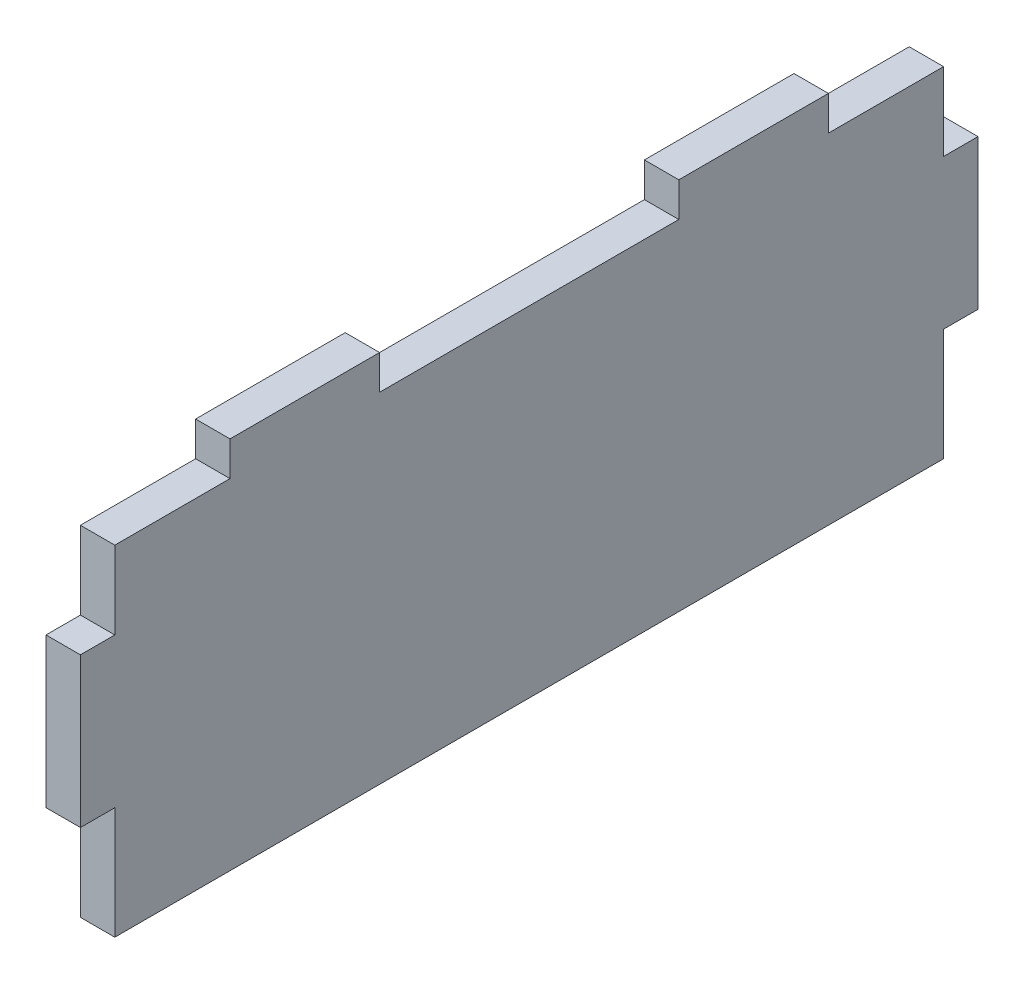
ISO-10303-21;
HEADER;
FILE_DESCRIPTION(('STEP AP214'),'2;1');
FILE_NAME('part.step','',(''),(''),'','','');
FILE_SCHEMA(('AUTOMOTIVE_DESIGN { 1 0 10303 214 1 1 1 1 }'));
ENDSEC;
DATA;
#1=APPLICATION_CONTEXT('core data for automotive mechanical design processes');
#2=APPLICATION_PROTOCOL_DEFINITION('international standard','automotive_design',2000,#1);
#3=PRODUCT_CONTEXT('',#1,'mechanical');
#4=PRODUCT('Part','Part','',(#3));
#5=PRODUCT_RELATED_PRODUCT_CATEGORY('part','',(#4));
#6=PRODUCT_DEFINITION_FORMATION('','',#4);
#7=PRODUCT_DEFINITION_CONTEXT('part definition',#1,'design');
#8=PRODUCT_DEFINITION('design','',#6,#7);
#9=PRODUCT_DEFINITION_SHAPE('','',#8);
#10=(LENGTH_UNIT() NAMED_UNIT(*) SI_UNIT(.MILLI.,.METRE.));
#11=(NAMED_UNIT(*) PLANE_ANGLE_UNIT() SI_UNIT($,.RADIAN.));
#12=(NAMED_UNIT(*) SI_UNIT($,.STERADIAN.) SOLID_ANGLE_UNIT());
#13=UNCERTAINTY_MEASURE_WITH_UNIT(LENGTH_MEASURE(1.E-05),#10,'distance_accuracy_value','');
#14=(GEOMETRIC_REPRESENTATION_CONTEXT(3) GLOBAL_UNCERTAINTY_ASSIGNED_CONTEXT((#13)) GLOBAL_UNIT_ASSIGNED_CONTEXT((#10,
#11,#12)) REPRESENTATION_CONTEXT('',''));
#15=CARTESIAN_POINT('',(0.,0.,0.));
#16=DIRECTION('',(0.,0.,1.));
#17=DIRECTION('',(1.,0.,0.));
#18=AXIS2_PLACEMENT_3D('',#15,#16,#17);
#19=CARTESIAN_POINT('',(5.842,59.2737638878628,-1.2954153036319E-13));
#20=DIRECTION('',(0.,1.,0.));
#21=DIRECTION('',(0.,0.,1.));
#22=AXIS2_PLACEMENT_3D('',#19,#20,#21);
#23=PLANE('',#22);
#24=DIRECTION('',(0.,0.,-1.));
#25=VECTOR('',#24,1.);
#26=CARTESIAN_POINT('',(0.,59.2737638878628,-1.2954153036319E-13));
#27=LINE('',#26,#25);
#28=CARTESIAN_POINT('',(0.,59.2737638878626,-101.6));
#29=VERTEX_POINT('',#28);
#30=CARTESIAN_POINT('',(0.,59.2737638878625,-127.));
#31=VERTEX_POINT('',#30);
#32=EDGE_CURVE('E199',#29,#31,#27,.T.);
#33=ORIENTED_EDGE('',*,*,#32,.F.);
#34=DIRECTION('',(-1.,0.,0.));
#35=VECTOR('',#34,1.);
#36=CARTESIAN_POINT('',(5.842,59.2737638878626,-101.6));
#37=LINE('',#36,#35);
#38=CARTESIAN_POINT('',(5.842,59.2737638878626,-101.6));
#39=VERTEX_POINT('',#38);
#40=EDGE_CURVE('E11',#39,#29,#37,.T.);
#41=ORIENTED_EDGE('',*,*,#40,.F.);
#42=DIRECTION('',(0.,0.,-1.));
#43=VECTOR('',#42,1.);
#44=CARTESIAN_POINT('',(5.842,59.2737638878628,-1.2954153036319E-13));
#45=LINE('',#44,#43);
#46=CARTESIAN_POINT('',(5.842,59.2737638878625,-127.));
#47=VERTEX_POINT('',#46);
#48=EDGE_CURVE('E249',#39,#47,#45,.T.);
#49=ORIENTED_EDGE('',*,*,#48,.T.);
#50=DIRECTION('',(-1.,0.,0.));
#51=VECTOR('',#50,1.);
#52=CARTESIAN_POINT('',(5.842,59.2737638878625,-127.));
#53=LINE('',#52,#51);
#54=EDGE_CURVE('E122',#47,#31,#53,.T.);
#55=ORIENTED_EDGE('',*,*,#54,.T.);
#56=EDGE_LOOP('',(#33,#41,#49,#55));
#57=FACE_BOUND('',#56,.T.);
#58=ADVANCED_FACE('F35',(#57),#23,.T.);
#59=CARTESIAN_POINT('',(5.842,0.,-101.6));
#60=DIRECTION('',(0.,0.,1.));
#61=DIRECTION('',(1.,0.,0.));
#62=AXIS2_PLACEMENT_3D('',#59,#60,#61);
#63=PLANE('',#62);
#64=DIRECTION('',(0.,1.,0.));
#65=VECTOR('',#64,1.);
#66=CARTESIAN_POINT('',(0.,0.,-101.6));
#67=LINE('',#66,#65);
#68=CARTESIAN_POINT('',(0.,53.4317638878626,-101.6));
#69=VERTEX_POINT('',#68);
#70=EDGE_CURVE('E202',#69,#29,#67,.T.);
#71=ORIENTED_EDGE('',*,*,#70,.F.);
#72=DIRECTION('',(-1.,0.,0.));
#73=VECTOR('',#72,1.);
#74=CARTESIAN_POINT('',(5.842,53.4317638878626,-101.6));
#75=LINE('',#74,#73);
#76=CARTESIAN_POINT('',(5.842,53.4317638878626,-101.6));
#77=VERTEX_POINT('',#76);
#78=EDGE_CURVE('E43',#77,#69,#75,.T.);
#79=ORIENTED_EDGE('',*,*,#78,.F.);
#80=DIRECTION('',(0.,1.,0.));
#81=VECTOR('',#80,1.);
#82=CARTESIAN_POINT('',(5.842,0.,-101.6));
#83=LINE('',#82,#81);
#84=EDGE_CURVE('E306',#77,#39,#83,.T.);
#85=ORIENTED_EDGE('',*,*,#84,.T.);
#86=ORIENTED_EDGE('',*,*,#40,.T.);
#87=EDGE_LOOP('',(#71,#79,#85,#86));
#88=FACE_BOUND('',#87,.T.);
#89=ADVANCED_FACE('F294',(#88),#63,.T.);
#90=CARTESIAN_POINT('',(5.842,53.4317638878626,0.));
#91=DIRECTION('',(0.,1.,0.));
#92=DIRECTION('',(0.,0.,1.));
#93=AXIS2_PLACEMENT_3D('',#90,#91,#92);
#94=PLANE('',#93);
#95=DIRECTION('',(0.,0.,-1.));
#96=VECTOR('',#95,1.);
#97=CARTESIAN_POINT('',(0.,53.4317638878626,0.));
#98=LINE('',#97,#96);
#99=CARTESIAN_POINT('',(0.,53.4317638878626,-50.8));
#100=VERTEX_POINT('',#99);
#101=EDGE_CURVE('E205',#100,#69,#98,.T.);
#102=ORIENTED_EDGE('',*,*,#101,.F.);
#103=DIRECTION('',(-1.,0.,0.));
#104=VECTOR('',#103,1.);
#105=CARTESIAN_POINT('',(5.842,53.4317638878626,-50.8));
#106=LINE('',#105,#104);
#107=CARTESIAN_POINT('',(5.842,53.4317638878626,-50.8));
#108=VERTEX_POINT('',#107);
#109=EDGE_CURVE('E283',#108,#100,#106,.T.);
#110=ORIENTED_EDGE('',*,*,#109,.F.);
#111=DIRECTION('',(0.,0.,-1.));
#112=VECTOR('',#111,1.);
#113=CARTESIAN_POINT('',(5.842,53.4317638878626,0.));
#114=LINE('',#113,#112);
#115=EDGE_CURVE('E290',#108,#77,#114,.T.);
#116=ORIENTED_EDGE('',*,*,#115,.T.);
#117=ORIENTED_EDGE('',*,*,#78,.T.);
#118=EDGE_LOOP('',(#102,#110,#116,#117));
#119=FACE_BOUND('',#118,.T.);
#120=ADVANCED_FACE('F288',(#119),#94,.T.);
#121=CARTESIAN_POINT('',(5.842,0.,-50.8));
#122=DIRECTION('',(0.,0.,-1.));
#123=DIRECTION('',(-1.,0.,0.));
#124=AXIS2_PLACEMENT_3D('',#121,#122,#123);
#125=PLANE('',#124);
#126=DIRECTION('',(0.,-1.,0.));
#127=VECTOR('',#126,1.);
#128=CARTESIAN_POINT('',(0.,0.,-50.8));
#129=LINE('',#128,#127);
#130=CARTESIAN_POINT('',(0.,59.2737638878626,-50.8));
#131=VERTEX_POINT('',#130);
#132=EDGE_CURVE('E208',#131,#100,#129,.T.);
#133=ORIENTED_EDGE('',*,*,#132,.F.);
#134=DIRECTION('',(-1.,0.,0.));
#135=VECTOR('',#134,1.);
#136=CARTESIAN_POINT('',(5.842,59.2737638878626,-50.8));
#137=LINE('',#136,#135);
#138=CARTESIAN_POINT('',(5.842,59.2737638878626,-50.8));
#139=VERTEX_POINT('',#138);
#140=EDGE_CURVE('E281',#139,#131,#137,.T.);
#141=ORIENTED_EDGE('',*,*,#140,.F.);
#142=DIRECTION('',(0.,-1.,0.));
#143=VECTOR('',#142,1.);
#144=CARTESIAN_POINT('',(5.842,0.,-50.8));
#145=LINE('',#144,#143);
#146=EDGE_CURVE('E303',#139,#108,#145,.T.);
#147=ORIENTED_EDGE('',*,*,#146,.T.);
#148=ORIENTED_EDGE('',*,*,#109,.T.);
#149=EDGE_LOOP('',(#133,#141,#147,#148));
#150=FACE_BOUND('',#149,.T.);
#151=ADVANCED_FACE('F300',(#150),#125,.T.);
#152=CARTESIAN_POINT('',(5.842,59.2737638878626,0.));
#153=DIRECTION('',(0.,1.,0.));
#154=DIRECTION('',(0.,0.,1.));
#155=AXIS2_PLACEMENT_3D('',#152,#153,#154);
#156=PLANE('',#155);
#157=DIRECTION('',(0.,0.,-1.));
#158=VECTOR('',#157,1.);
#159=CARTESIAN_POINT('',(0.,59.2737638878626,0.));
#160=LINE('',#159,#158);
#161=CARTESIAN_POINT('',(0.,59.2737638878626,-25.4));
#162=VERTEX_POINT('',#161);
#163=EDGE_CURVE('E211',#162,#131,#160,.T.);
#164=ORIENTED_EDGE('',*,*,#163,.F.);
#165=DIRECTION('',(-1.,0.,0.));
#166=VECTOR('',#165,1.);
#167=CARTESIAN_POINT('',(5.842,59.2737638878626,-25.4));
#168=LINE('',#167,#166);
#169=CARTESIAN_POINT('',(5.842,59.2737638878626,-25.4));
#170=VERTEX_POINT('',#169);
#171=EDGE_CURVE('E279',#170,#162,#168,.T.);
#172=ORIENTED_EDGE('',*,*,#171,.F.);
#173=DIRECTION('',(0.,0.,-1.));
#174=VECTOR('',#173,1.);
#175=CARTESIAN_POINT('',(5.842,59.2737638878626,0.));
#176=LINE('',#175,#174);
#177=EDGE_CURVE('E308',#170,#139,#176,.T.);
#178=ORIENTED_EDGE('',*,*,#177,.T.);
#179=ORIENTED_EDGE('',*,*,#140,.T.);
#180=EDGE_LOOP('',(#164,#172,#178,#179));
#181=FACE_BOUND('',#180,.T.);
#182=ADVANCED_FACE('F366',(#181),#156,.T.);
#183=CARTESIAN_POINT('',(5.842,0.,-25.4));
#184=DIRECTION('',(0.,0.,1.));
#185=DIRECTION('',(1.,0.,0.));
#186=AXIS2_PLACEMENT_3D('',#183,#184,#185);
#187=PLANE('',#186);
#188=DIRECTION('',(0.,1.,0.));
#189=VECTOR('',#188,1.);
#190=CARTESIAN_POINT('',(0.,0.,-25.4));
#191=LINE('',#190,#189);
#192=CARTESIAN_POINT('',(0.,53.4317638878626,-25.4));
#193=VERTEX_POINT('',#192);
#194=EDGE_CURVE('E214',#193,#162,#191,.T.);
#195=ORIENTED_EDGE('',*,*,#194,.F.);
#196=DIRECTION('',(-1.,0.,0.));
#197=VECTOR('',#196,1.);
#198=CARTESIAN_POINT('',(5.842,53.4317638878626,-25.4));
#199=LINE('',#198,#197);
#200=CARTESIAN_POINT('',(5.842,53.4317638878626,-25.4));
#201=VERTEX_POINT('',#200);
#202=EDGE_CURVE('E277',#201,#193,#199,.T.);
#203=ORIENTED_EDGE('',*,*,#202,.F.);
#204=DIRECTION('',(0.,1.,0.));
#205=VECTOR('',#204,1.);
#206=CARTESIAN_POINT('',(5.842,0.,-25.4));
#207=LINE('',#206,#205);
#208=EDGE_CURVE('E314',#201,#170,#207,.T.);
#209=ORIENTED_EDGE('',*,*,#208,.T.);
#210=ORIENTED_EDGE('',*,*,#171,.T.);
#211=EDGE_LOOP('',(#195,#203,#209,#210));
#212=FACE_BOUND('',#211,.T.);
#213=ADVANCED_FACE('F369',(#212),#187,.T.);
#214=CARTESIAN_POINT('',(5.842,53.4317638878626,0.));
#215=DIRECTION('',(0.,1.,0.));
#216=DIRECTION('',(0.,0.,1.));
#217=AXIS2_PLACEMENT_3D('',#214,#215,#216);
#218=PLANE('',#217);
#219=DIRECTION('',(0.,0.,-1.));
#220=VECTOR('',#219,1.);
#221=CARTESIAN_POINT('',(0.,53.4317638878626,0.));
#222=LINE('',#221,#220);
#223=CARTESIAN_POINT('',(0.,53.4317638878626,-5.842));
#224=VERTEX_POINT('',#223);
#225=EDGE_CURVE('E217',#224,#193,#222,.T.);
#226=ORIENTED_EDGE('',*,*,#225,.F.);
#227=DIRECTION('',(-1.,0.,0.));
#228=VECTOR('',#227,1.);
#229=CARTESIAN_POINT('',(5.842,53.4317638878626,-5.842));
#230=LINE('',#229,#228);
#231=CARTESIAN_POINT('',(5.842,53.4317638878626,-5.842));
#232=VERTEX_POINT('',#231);
#233=EDGE_CURVE('E275',#232,#224,#230,.T.);
#234=ORIENTED_EDGE('',*,*,#233,.F.);
#235=DIRECTION('',(0.,0.,-1.));
#236=VECTOR('',#235,1.);
#237=CARTESIAN_POINT('',(5.842,53.4317638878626,0.));
#238=LINE('',#237,#236);
#239=EDGE_CURVE('E317',#232,#201,#238,.T.);
#240=ORIENTED_EDGE('',*,*,#239,.T.);
#241=ORIENTED_EDGE('',*,*,#202,.T.);
#242=EDGE_LOOP('',(#226,#234,#240,#241));
#243=FACE_BOUND('',#242,.T.);
#244=ADVANCED_FACE('F373',(#243),#218,.T.);
#245=CARTESIAN_POINT('',(5.842,0.,-5.842));
#246=DIRECTION('',(0.,0.,1.));
#247=DIRECTION('',(1.,0.,0.));
#248=AXIS2_PLACEMENT_3D('',#245,#246,#247);
#249=PLANE('',#248);
#250=DIRECTION('',(0.,1.,0.));
#251=VECTOR('',#250,1.);
#252=CARTESIAN_POINT('',(0.,0.,-5.842));
#253=LINE('',#252,#251);
#254=CARTESIAN_POINT('',(0.,40.2237638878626,-5.842));
#255=VERTEX_POINT('',#254);
#256=EDGE_CURVE('E220',#255,#224,#253,.T.);
#257=ORIENTED_EDGE('',*,*,#256,.F.);
#258=DIRECTION('',(-1.,0.,0.));
#259=VECTOR('',#258,1.);
#260=CARTESIAN_POINT('',(5.842,40.2237638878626,-5.842));
#261=LINE('',#260,#259);
#262=CARTESIAN_POINT('',(5.842,40.2237638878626,-5.842));
#263=VERTEX_POINT('',#262);
#264=EDGE_CURVE('E273',#263,#255,#261,.T.);
#265=ORIENTED_EDGE('',*,*,#264,.F.);
#266=DIRECTION('',(0.,1.,0.));
#267=VECTOR('',#266,1.);
#268=CARTESIAN_POINT('',(5.842,0.,-5.842));
#269=LINE('',#268,#267);
#270=EDGE_CURVE('E320',#263,#232,#269,.T.);
#271=ORIENTED_EDGE('',*,*,#270,.T.);
#272=ORIENTED_EDGE('',*,*,#233,.T.);
#273=EDGE_LOOP('',(#257,#265,#271,#272));
#274=FACE_BOUND('',#273,.T.);
#275=ADVANCED_FACE('F377',(#274),#249,.T.);
#276=CARTESIAN_POINT('',(5.842,40.2237638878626,0.));
#277=DIRECTION('',(0.,1.,0.));
#278=DIRECTION('',(0.,0.,1.));
#279=AXIS2_PLACEMENT_3D('',#276,#277,#278);
#280=PLANE('',#279);
#281=DIRECTION('',(0.,0.,-1.));
#282=VECTOR('',#281,1.);
#283=CARTESIAN_POINT('',(0.,40.2237638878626,0.));
#284=LINE('',#283,#282);
#285=CARTESIAN_POINT('',(0.,40.2237638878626,0.));
#286=VERTEX_POINT('',#285);
#287=EDGE_CURVE('E223',#286,#255,#284,.T.);
#288=ORIENTED_EDGE('',*,*,#287,.F.);
#289=DIRECTION('',(-1.,0.,0.));
#290=VECTOR('',#289,1.);
#291=CARTESIAN_POINT('',(5.842,40.2237638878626,0.));
#292=LINE('',#291,#290);
#293=CARTESIAN_POINT('',(5.842,40.2237638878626,0.));
#294=VERTEX_POINT('',#293);
#295=EDGE_CURVE('E271',#294,#286,#292,.T.);
#296=ORIENTED_EDGE('',*,*,#295,.F.);
#297=DIRECTION('',(0.,0.,-1.));
#298=VECTOR('',#297,1.);
#299=CARTESIAN_POINT('',(5.842,40.2237638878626,0.));
#300=LINE('',#299,#298);
#301=EDGE_CURVE('E323',#294,#263,#300,.T.);
#302=ORIENTED_EDGE('',*,*,#301,.T.);
#303=ORIENTED_EDGE('',*,*,#264,.T.);
#304=EDGE_LOOP('',(#288,#296,#302,#303));
#305=FACE_BOUND('',#304,.T.);
#306=ADVANCED_FACE('F381',(#305),#280,.T.);
#307=CARTESIAN_POINT('',(5.842,0.,0.));
#308=DIRECTION('',(0.,0.,1.));
#309=DIRECTION('',(1.,0.,0.));
#310=AXIS2_PLACEMENT_3D('',#307,#308,#309);
#311=PLANE('',#310);
#312=DIRECTION('',(0.,1.,0.));
#313=VECTOR('',#312,1.);
#314=CARTESIAN_POINT('',(0.,0.,0.));
#315=LINE('',#314,#313);
#316=CARTESIAN_POINT('',(0.,14.8237638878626,0.));
#317=VERTEX_POINT('',#316);
#318=EDGE_CURVE('E226',#317,#286,#315,.T.);
#319=ORIENTED_EDGE('',*,*,#318,.F.);
#320=DIRECTION('',(-1.,0.,0.));
#321=VECTOR('',#320,1.);
#322=CARTESIAN_POINT('',(5.842,14.8237638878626,0.));
#323=LINE('',#322,#321);
#324=CARTESIAN_POINT('',(5.842,14.8237638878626,0.));
#325=VERTEX_POINT('',#324);
#326=EDGE_CURVE('E269',#325,#317,#323,.T.);
#327=ORIENTED_EDGE('',*,*,#326,.F.);
#328=DIRECTION('',(0.,1.,0.));
#329=VECTOR('',#328,1.);
#330=CARTESIAN_POINT('',(5.842,0.,0.));
#331=LINE('',#330,#329);
#332=EDGE_CURVE('E326',#325,#294,#331,.T.);
#333=ORIENTED_EDGE('',*,*,#332,.T.);
#334=ORIENTED_EDGE('',*,*,#295,.T.);
#335=EDGE_LOOP('',(#319,#327,#333,#334));
#336=FACE_BOUND('',#335,.T.);
#337=ADVANCED_FACE('F385',(#336),#311,.T.);
#338=CARTESIAN_POINT('',(5.842,14.8237638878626,0.));
#339=DIRECTION('',(0.,-1.,0.));
#340=DIRECTION('',(0.,0.,-1.));
#341=AXIS2_PLACEMENT_3D('',#338,#339,#340);
#342=PLANE('',#341);
#343=DIRECTION('',(0.,0.,1.));
#344=VECTOR('',#343,1.);
#345=CARTESIAN_POINT('',(0.,14.8237638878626,0.));
#346=LINE('',#345,#344);
#347=CARTESIAN_POINT('',(0.,14.8237638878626,-5.842));
#348=VERTEX_POINT('',#347);
#349=EDGE_CURVE('E229',#348,#317,#346,.T.);
#350=ORIENTED_EDGE('',*,*,#349,.F.);
#351=DIRECTION('',(-1.,0.,0.));
#352=VECTOR('',#351,1.);
#353=CARTESIAN_POINT('',(5.842,14.8237638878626,-5.842));
#354=LINE('',#353,#352);
#355=CARTESIAN_POINT('',(5.842,14.8237638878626,-5.842));
#356=VERTEX_POINT('',#355);
#357=EDGE_CURVE('E267',#356,#348,#354,.T.);
#358=ORIENTED_EDGE('',*,*,#357,.F.);
#359=DIRECTION('',(0.,0.,1.));
#360=VECTOR('',#359,1.);
#361=CARTESIAN_POINT('',(5.842,14.8237638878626,0.));
#362=LINE('',#361,#360);
#363=EDGE_CURVE('E329',#356,#325,#362,.T.);
#364=ORIENTED_EDGE('',*,*,#363,.T.);
#365=ORIENTED_EDGE('',*,*,#326,.T.);
#366=EDGE_LOOP('',(#350,#358,#364,#365));
#367=FACE_BOUND('',#366,.T.);
#368=ADVANCED_FACE('F389',(#367),#342,.T.);
#369=CARTESIAN_POINT('',(5.842,0.,-5.842));
#370=DIRECTION('',(0.,0.,1.));
#371=DIRECTION('',(0.,-1.,0.));
#372=AXIS2_PLACEMENT_3D('',#369,#370,#371);
#373=PLANE('',#372);
#374=DIRECTION('',(0.,1.,0.));
#375=VECTOR('',#374,1.);
#376=CARTESIAN_POINT('',(0.,0.,-5.842));
#377=LINE('',#376,#375);
#378=CARTESIAN_POINT('',(0.,-4.22623611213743,-5.842));
#379=VERTEX_POINT('',#378);
#380=EDGE_CURVE('E232',#379,#348,#377,.T.);
#381=ORIENTED_EDGE('',*,*,#380,.F.);
#382=DIRECTION('',(-1.,0.,0.));
#383=VECTOR('',#382,1.);
#384=CARTESIAN_POINT('',(5.842,-4.22623611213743,-5.842));
#385=LINE('',#384,#383);
#386=CARTESIAN_POINT('',(5.842,-4.22623611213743,-5.842));
#387=VERTEX_POINT('',#386);
#388=EDGE_CURVE('E265',#387,#379,#385,.T.);
#389=ORIENTED_EDGE('',*,*,#388,.F.);
#390=DIRECTION('',(0.,1.,0.));
#391=VECTOR('',#390,1.);
#392=CARTESIAN_POINT('',(5.842,0.,-5.842));
#393=LINE('',#392,#391);
#394=EDGE_CURVE('E332',#387,#356,#393,.T.);
#395=ORIENTED_EDGE('',*,*,#394,.T.);
#396=ORIENTED_EDGE('',*,*,#357,.T.);
#397=EDGE_LOOP('',(#381,#389,#395,#396));
#398=FACE_BOUND('',#397,.T.);
#399=ADVANCED_FACE('F393',(#398),#373,.T.);
#400=CARTESIAN_POINT('',(5.842,-4.22623611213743,0.));
#401=DIRECTION('',(0.,1.,0.));
#402=DIRECTION('',(0.,0.,1.));
#403=AXIS2_PLACEMENT_3D('',#400,#401,#402);
#404=PLANE('',#403);
#405=DIRECTION('',(0.,0.,-1.));
#406=VECTOR('',#405,1.);
#407=CARTESIAN_POINT('',(0.,-4.22623611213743,0.));
#408=LINE('',#407,#406);
#409=CARTESIAN_POINT('',(0.,-4.22623611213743,-146.558));
#410=VERTEX_POINT('',#409);
#411=EDGE_CURVE('E235',#379,#410,#408,.T.);
#412=ORIENTED_EDGE('',*,*,#411,.T.);
#413=DIRECTION('',(-1.,0.,0.));
#414=VECTOR('',#413,1.);
#415=CARTESIAN_POINT('',(5.842,-4.22623611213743,-146.558));
#416=LINE('',#415,#414);
#417=CARTESIAN_POINT('',(5.842,-4.22623611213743,-146.558));
#418=VERTEX_POINT('',#417);
#419=EDGE_CURVE('E262',#418,#410,#416,.T.);
#420=ORIENTED_EDGE('',*,*,#419,.F.);
#421=DIRECTION('',(0.,0.,-1.));
#422=VECTOR('',#421,1.);
#423=CARTESIAN_POINT('',(5.842,-4.22623611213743,0.));
#424=LINE('',#423,#422);
#425=EDGE_CURVE('E335',#387,#418,#424,.T.);
#426=ORIENTED_EDGE('',*,*,#425,.F.);
#427=ORIENTED_EDGE('',*,*,#388,.T.);
#428=EDGE_LOOP('',(#412,#420,#426,#427));
#429=FACE_BOUND('',#428,.T.);
#430=ADVANCED_FACE('F397',(#429),#404,.F.);
#431=CARTESIAN_POINT('',(5.842,-2.13532895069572E-13,-146.558));
#432=DIRECTION('',(0.,0.,1.));
#433=DIRECTION('',(0.,-1.,0.));
#434=AXIS2_PLACEMENT_3D('',#431,#432,#433);
#435=PLANE('',#434);
#436=DIRECTION('',(0.,1.,0.));
#437=VECTOR('',#436,1.);
#438=CARTESIAN_POINT('',(0.,-2.13532895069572E-13,-146.558));
#439=LINE('',#438,#437);
#440=CARTESIAN_POINT('',(0.,14.8237638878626,-146.558));
#441=VERTEX_POINT('',#440);
#442=EDGE_CURVE('E237',#410,#441,#439,.T.);
#443=ORIENTED_EDGE('',*,*,#442,.T.);
#444=DIRECTION('',(-1.,0.,0.));
#445=VECTOR('',#444,1.);
#446=CARTESIAN_POINT('',(5.842,14.8237638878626,-146.558));
#447=LINE('',#446,#445);
#448=CARTESIAN_POINT('',(5.842,14.8237638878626,-146.558));
#449=VERTEX_POINT('',#448);
#450=EDGE_CURVE('E259',#449,#441,#447,.T.);
#451=ORIENTED_EDGE('',*,*,#450,.F.);
#452=DIRECTION('',(0.,1.,0.));
#453=VECTOR('',#452,1.);
#454=CARTESIAN_POINT('',(5.842,-2.13532895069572E-13,-146.558));
#455=LINE('',#454,#453);
#456=EDGE_CURVE('E337',#418,#449,#455,.T.);
#457=ORIENTED_EDGE('',*,*,#456,.F.);
#458=ORIENTED_EDGE('',*,*,#419,.T.);
#459=EDGE_LOOP('',(#443,#451,#457,#458));
#460=FACE_BOUND('',#459,.T.);
#461=ADVANCED_FACE('F401',(#460),#435,.F.);
#462=CARTESIAN_POINT('',(5.842,14.8237638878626,0.));
#463=DIRECTION('',(0.,1.,0.));
#464=DIRECTION('',(0.,0.,1.));
#465=AXIS2_PLACEMENT_3D('',#462,#463,#464);
#466=PLANE('',#465);
#467=DIRECTION('',(0.,0.,-1.));
#468=VECTOR('',#467,1.);
#469=CARTESIAN_POINT('',(0.,14.8237638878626,0.));
#470=LINE('',#469,#468);
#471=CARTESIAN_POINT('',(0.,14.8237638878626,-152.4));
#472=VERTEX_POINT('',#471);
#473=EDGE_CURVE('E239',#441,#472,#470,.T.);
#474=ORIENTED_EDGE('',*,*,#473,.T.);
#475=DIRECTION('',(-1.,0.,0.));
#476=VECTOR('',#475,1.);
#477=CARTESIAN_POINT('',(5.842,14.8237638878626,-152.4));
#478=LINE('',#477,#476);
#479=CARTESIAN_POINT('',(5.842,14.8237638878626,-152.4));
#480=VERTEX_POINT('',#479);
#481=EDGE_CURVE('E256',#480,#472,#478,.T.);
#482=ORIENTED_EDGE('',*,*,#481,.F.);
#483=DIRECTION('',(0.,0.,-1.));
#484=VECTOR('',#483,1.);
#485=CARTESIAN_POINT('',(5.842,14.8237638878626,0.));
#486=LINE('',#485,#484);
#487=EDGE_CURVE('E339',#449,#480,#486,.T.);
#488=ORIENTED_EDGE('',*,*,#487,.F.);
#489=ORIENTED_EDGE('',*,*,#450,.T.);
#490=EDGE_LOOP('',(#474,#482,#488,#489));
#491=FACE_BOUND('',#490,.T.);
#492=ADVANCED_FACE('F405',(#491),#466,.F.);
#493=CARTESIAN_POINT('',(5.842,0.,-152.4));
#494=DIRECTION('',(0.,0.,1.));
#495=DIRECTION('',(1.,0.,0.));
#496=AXIS2_PLACEMENT_3D('',#493,#494,#495);
#497=PLANE('',#496);
#498=DIRECTION('',(0.,1.,0.));
#499=VECTOR('',#498,1.);
#500=CARTESIAN_POINT('',(0.,0.,-152.4));
#501=LINE('',#500,#499);
#502=CARTESIAN_POINT('',(0.,40.2237638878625,-152.4));
#503=VERTEX_POINT('',#502);
#504=EDGE_CURVE('E241',#472,#503,#501,.T.);
#505=ORIENTED_EDGE('',*,*,#504,.T.);
#506=DIRECTION('',(-1.,0.,0.));
#507=VECTOR('',#506,1.);
#508=CARTESIAN_POINT('',(5.842,40.2237638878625,-152.4));
#509=LINE('',#508,#507);
#510=CARTESIAN_POINT('',(5.842,40.2237638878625,-152.4));
#511=VERTEX_POINT('',#510);
#512=EDGE_CURVE('E253',#511,#503,#509,.T.);
#513=ORIENTED_EDGE('',*,*,#512,.F.);
#514=DIRECTION('',(0.,1.,0.));
#515=VECTOR('',#514,1.);
#516=CARTESIAN_POINT('',(5.842,0.,-152.4));
#517=LINE('',#516,#515);
#518=EDGE_CURVE('E341',#480,#511,#517,.T.);
#519=ORIENTED_EDGE('',*,*,#518,.F.);
#520=ORIENTED_EDGE('',*,*,#481,.T.);
#521=EDGE_LOOP('',(#505,#513,#519,#520));
#522=FACE_BOUND('',#521,.T.);
#523=ADVANCED_FACE('F347',(#522),#497,.F.);
#524=CARTESIAN_POINT('',(5.842,40.2237638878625,0.));
#525=DIRECTION('',(0.,-1.,0.));
#526=DIRECTION('',(0.,0.,-1.));
#527=AXIS2_PLACEMENT_3D('',#524,#525,#526);
#528=PLANE('',#527);
#529=DIRECTION('',(0.,0.,1.));
#530=VECTOR('',#529,1.);
#531=CARTESIAN_POINT('',(0.,40.2237638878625,0.));
#532=LINE('',#531,#530);
#533=CARTESIAN_POINT('',(0.,40.2237638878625,-146.558));
#534=VERTEX_POINT('',#533);
#535=EDGE_CURVE('E243',#503,#534,#532,.T.);
#536=ORIENTED_EDGE('',*,*,#535,.T.);
#537=DIRECTION('',(-1.,0.,0.));
#538=VECTOR('',#537,1.);
#539=CARTESIAN_POINT('',(5.842,40.2237638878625,-146.558));
#540=LINE('',#539,#538);
#541=CARTESIAN_POINT('',(5.842,40.2237638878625,-146.558));
#542=VERTEX_POINT('',#541);
#543=EDGE_CURVE('E191',#542,#534,#540,.T.);
#544=ORIENTED_EDGE('',*,*,#543,.F.);
#545=DIRECTION('',(0.,0.,1.));
#546=VECTOR('',#545,1.);
#547=CARTESIAN_POINT('',(5.842,40.2237638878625,0.));
#548=LINE('',#547,#546);
#549=EDGE_CURVE('E182',#511,#542,#548,.T.);
#550=ORIENTED_EDGE('',*,*,#549,.F.);
#551=ORIENTED_EDGE('',*,*,#512,.T.);
#552=EDGE_LOOP('',(#536,#544,#550,#551));
#553=FACE_BOUND('',#552,.T.);
#554=ADVANCED_FACE('F351',(#553),#528,.F.);
#555=CARTESIAN_POINT('',(5.842,0.,-146.558));
#556=DIRECTION('',(0.,0.,1.));
#557=DIRECTION('',(1.,0.,0.));
#558=AXIS2_PLACEMENT_3D('',#555,#556,#557);
#559=PLANE('',#558);
#560=DIRECTION('',(0.,1.,0.));
#561=VECTOR('',#560,1.);
#562=CARTESIAN_POINT('',(0.,0.,-146.558));
#563=LINE('',#562,#561);
#564=CARTESIAN_POINT('',(0.,53.4317638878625,-146.558));
#565=VERTEX_POINT('',#564);
#566=EDGE_CURVE('E190',#534,#565,#563,.T.);
#567=ORIENTED_EDGE('',*,*,#566,.T.);
#568=DIRECTION('',(-1.,0.,0.));
#569=VECTOR('',#568,1.);
#570=CARTESIAN_POINT('',(5.842,53.4317638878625,-146.558));
#571=LINE('',#570,#569);
#572=CARTESIAN_POINT('',(5.842,53.4317638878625,-146.558));
#573=VERTEX_POINT('',#572);
#574=EDGE_CURVE('E187',#573,#565,#571,.T.);
#575=ORIENTED_EDGE('',*,*,#574,.F.);
#576=DIRECTION('',(0.,1.,0.));
#577=VECTOR('',#576,1.);
#578=CARTESIAN_POINT('',(5.842,0.,-146.558));
#579=LINE('',#578,#577);
#580=EDGE_CURVE('E176',#542,#573,#579,.T.);
#581=ORIENTED_EDGE('',*,*,#580,.F.);
#582=ORIENTED_EDGE('',*,*,#543,.T.);
#583=EDGE_LOOP('',(#567,#575,#581,#582));
#584=FACE_BOUND('',#583,.T.);
#585=ADVANCED_FACE('F188',(#584),#559,.F.);
#586=CARTESIAN_POINT('',(5.842,53.4317638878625,0.));
#587=DIRECTION('',(0.,-1.,0.));
#588=DIRECTION('',(0.,0.,-1.));
#589=AXIS2_PLACEMENT_3D('',#586,#587,#588);
#590=PLANE('',#589);
#591=DIRECTION('',(0.,0.,1.));
#592=VECTOR('',#591,1.);
#593=CARTESIAN_POINT('',(0.,53.4317638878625,0.));
#594=LINE('',#593,#592);
#595=CARTESIAN_POINT('',(0.,53.4317638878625,-127.));
#596=VERTEX_POINT('',#595);
#597=EDGE_CURVE('E115',#565,#596,#594,.T.);
#598=ORIENTED_EDGE('',*,*,#597,.T.);
#599=DIRECTION('',(-1.,0.,0.));
#600=VECTOR('',#599,1.);
#601=CARTESIAN_POINT('',(5.842,53.4317638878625,-127.));
#602=LINE('',#601,#600);
#603=CARTESIAN_POINT('',(5.842,53.4317638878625,-127.));
#604=VERTEX_POINT('',#603);
#605=EDGE_CURVE('E192',#604,#596,#602,.T.);
#606=ORIENTED_EDGE('',*,*,#605,.F.);
#607=DIRECTION('',(0.,0.,1.));
#608=VECTOR('',#607,1.);
#609=CARTESIAN_POINT('',(5.842,53.4317638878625,0.));
#610=LINE('',#609,#608);
#611=EDGE_CURVE('E180',#573,#604,#610,.T.);
#612=ORIENTED_EDGE('',*,*,#611,.F.);
#613=ORIENTED_EDGE('',*,*,#574,.T.);
#614=EDGE_LOOP('',(#598,#606,#612,#613));
#615=FACE_BOUND('',#614,.T.);
#616=ADVANCED_FACE('F194',(#615),#590,.F.);
#617=CARTESIAN_POINT('',(5.842,0.,-127.));
#618=DIRECTION('',(0.,0.,1.));
#619=DIRECTION('',(1.,0.,0.));
#620=AXIS2_PLACEMENT_3D('',#617,#618,#619);
#621=PLANE('',#620);
#622=DIRECTION('',(0.,1.,0.));
#623=VECTOR('',#622,1.);
#624=CARTESIAN_POINT('',(0.,0.,-127.));
#625=LINE('',#624,#623);
#626=EDGE_CURVE('E247',#596,#31,#625,.T.);
#627=ORIENTED_EDGE('',*,*,#626,.T.);
#628=ORIENTED_EDGE('',*,*,#54,.F.);
#629=DIRECTION('',(0.,1.,0.));
#630=VECTOR('',#629,1.);
#631=CARTESIAN_POINT('',(5.842,0.,-127.));
#632=LINE('',#631,#630);
#633=EDGE_CURVE('E51',#604,#47,#632,.T.);
#634=ORIENTED_EDGE('',*,*,#633,.F.);
#635=ORIENTED_EDGE('',*,*,#605,.T.);
#636=EDGE_LOOP('',(#627,#628,#634,#635));
#637=FACE_BOUND('',#636,.T.);
#638=ADVANCED_FACE('F354',(#637),#621,.F.);
#639=CARTESIAN_POINT('',(5.842,0.,0.));
#640=DIRECTION('',(1.,0.,0.));
#641=DIRECTION('',(0.,0.,-1.));
#642=AXIS2_PLACEMENT_3D('',#639,#640,#641);
#643=PLANE('',#642);
#644=ORIENTED_EDGE('',*,*,#48,.F.);
#645=ORIENTED_EDGE('',*,*,#84,.F.);
#646=ORIENTED_EDGE('',*,*,#115,.F.);
#647=ORIENTED_EDGE('',*,*,#146,.F.);
#648=ORIENTED_EDGE('',*,*,#177,.F.);
#649=ORIENTED_EDGE('',*,*,#208,.F.);
#650=ORIENTED_EDGE('',*,*,#239,.F.);
#651=ORIENTED_EDGE('',*,*,#270,.F.);
#652=ORIENTED_EDGE('',*,*,#301,.F.);
#653=ORIENTED_EDGE('',*,*,#332,.F.);
#654=ORIENTED_EDGE('',*,*,#363,.F.);
#655=ORIENTED_EDGE('',*,*,#394,.F.);
#656=ORIENTED_EDGE('',*,*,#425,.T.);
#657=ORIENTED_EDGE('',*,*,#456,.T.);
#658=ORIENTED_EDGE('',*,*,#487,.T.);
#659=ORIENTED_EDGE('',*,*,#518,.T.);
#660=ORIENTED_EDGE('',*,*,#549,.T.);
#661=ORIENTED_EDGE('',*,*,#580,.T.);
#662=ORIENTED_EDGE('',*,*,#611,.T.);
#663=ORIENTED_EDGE('',*,*,#633,.T.);
#664=EDGE_LOOP('',(#644,#645,#646,#647,#648,#649,#650,#651,#652,#653,#654,#655,#656,#657,#658,
#659,#660,#661,#662,#663));
#665=FACE_BOUND('',#664,.T.);
#666=ADVANCED_FACE('F178',(#665),#643,.T.);
#667=CARTESIAN_POINT('',(0.,0.,0.));
#668=DIRECTION('',(1.,0.,0.));
#669=DIRECTION('',(0.,0.,-1.));
#670=AXIS2_PLACEMENT_3D('',#667,#668,#669);
#671=PLANE('',#670);
#672=ORIENTED_EDGE('',*,*,#32,.T.);
#673=ORIENTED_EDGE('',*,*,#626,.F.);
#674=ORIENTED_EDGE('',*,*,#597,.F.);
#675=ORIENTED_EDGE('',*,*,#566,.F.);
#676=ORIENTED_EDGE('',*,*,#535,.F.);
#677=ORIENTED_EDGE('',*,*,#504,.F.);
#678=ORIENTED_EDGE('',*,*,#473,.F.);
#679=ORIENTED_EDGE('',*,*,#442,.F.);
#680=ORIENTED_EDGE('',*,*,#411,.F.);
#681=ORIENTED_EDGE('',*,*,#380,.T.);
#682=ORIENTED_EDGE('',*,*,#349,.T.);
#683=ORIENTED_EDGE('',*,*,#318,.T.);
#684=ORIENTED_EDGE('',*,*,#287,.T.);
#685=ORIENTED_EDGE('',*,*,#256,.T.);
#686=ORIENTED_EDGE('',*,*,#225,.T.);
#687=ORIENTED_EDGE('',*,*,#194,.T.);
#688=ORIENTED_EDGE('',*,*,#163,.T.);
#689=ORIENTED_EDGE('',*,*,#132,.T.);
#690=ORIENTED_EDGE('',*,*,#101,.T.);
#691=ORIENTED_EDGE('',*,*,#70,.T.);
#692=EDGE_LOOP('',(#672,#673,#674,#675,#676,#677,#678,#679,#680,#681,#682,#683,#684,#685,#686,
#687,#688,#689,#690,#691));
#693=FACE_BOUND('',#692,.T.);
#694=ADVANCED_FACE('F296',(#693),#671,.F.);
#695=CLOSED_SHELL('',(#58,#89,#120,#151,#182,#213,#244,#275,#306,#337,#368,#399,#430,#461,#492,
#523,#554,#585,#616,#638,#666,#694));
#696=MANIFOLD_SOLID_BREP('B2',#695);
#697=ADVANCED_BREP_SHAPE_REPRESENTATION('',(#18,#696),#14);
#698=SHAPE_DEFINITION_REPRESENTATION(#9,#697);
ENDSEC;
END-ISO-10303-21;
